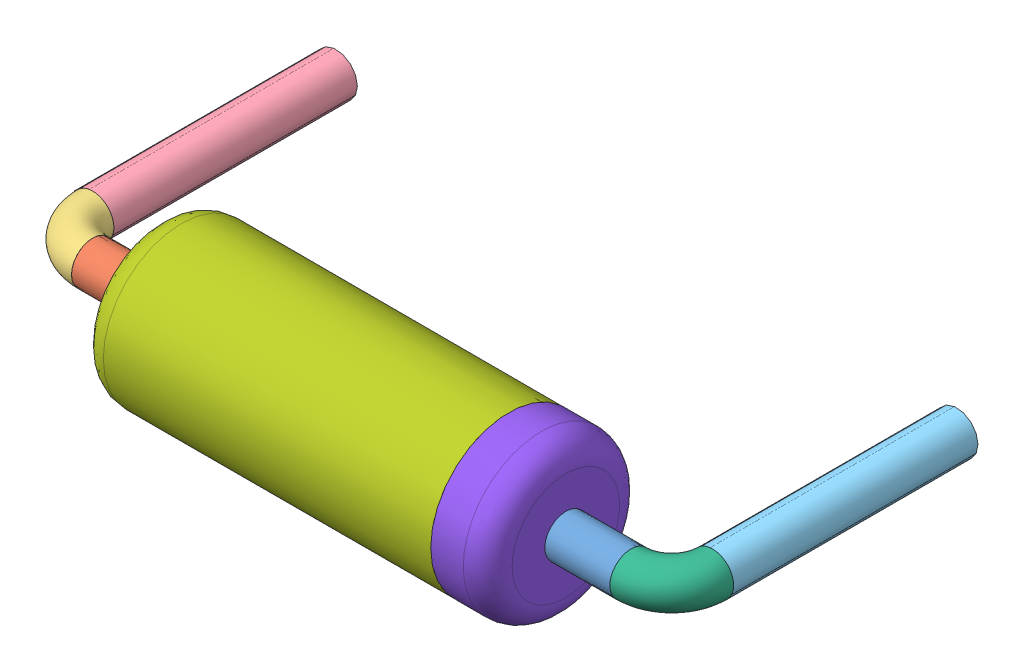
SolidWorks assembly User Library-DO-35_300mils.SLDASM, configuration Default (file format 4400). Lengths in mm.
Overall size (8.16 1.92 4.46).
8 component instances, 8 part files, 0 mates.
Components (placement in the parent):
- User Library-DO-35_300mils_Cylinder001-1: User Library-DO-35_300mils_Cylinder001.sldprt [Default] at origin size (1 0.52 0.52)
- User Library-DO-35_300mils_Cylinder002-1: User Library-DO-35_300mils_Cylinder002.sldprt [Default] at origin size (1 0.52 0.52)
- User Library-DO-35_300mils_Torus-1: User Library-DO-35_300mils_Torus.sldprt [Default] at origin size (0.77 0.55 0.77)
- User Library-DO-35_300mils_Cylinder003-1: User Library-DO-35_300mils_Cylinder003.sldprt [Default] at origin size (0.52 0.52 3)
- User Library-DO-35_300mils_Cylinder004-1: User Library-DO-35_300mils_Cylinder004.sldprt [Default] at origin size (0.52 0.52 3)
- User Library-DO-35_300mils_Torus_(Mirror_#1)-1: User Library-DO-35_300mils_Torus_(Mirror_#1).sldprt [Default] at origin size (0.77 0.55 0.77)
- User Library-DO-35_300mils_Fillet-1: User Library-DO-35_300mils_Fillet.sldprt [Default] at origin size (4.32 1.92 1.92)
- User Library-DO-35_300mils_Fillet001-1: User Library-DO-35_300mils_Fillet001.sldprt [Default] at origin size (0.7 1.92 1.92)
